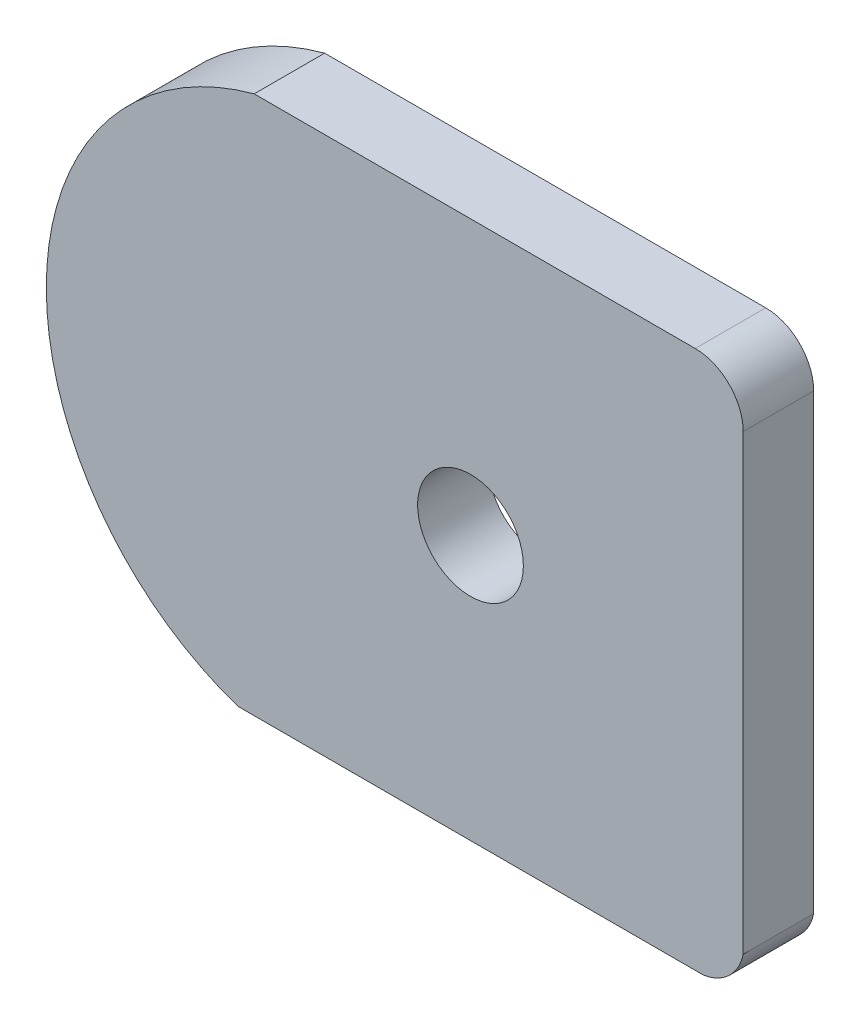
from build123d import *

# Parameters (mm, degrees)
BOSS_EXTRUDE1_DEPTH     = 2.54
CUT_EXTRUDE1_DEPTH      = 2.54
CUT_EXTRUDE1_DEPTH_BACK = 2.54
SKETCH4_R               = 1.905


with BuildPart() as part:
    # Sketch3 → Boss-Extrude1 (new body)
    with BuildSketch(Plane.XY):
        with BuildLine():
            Line((8.097404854, 9.881463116), (-7.795903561, 9.881463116))
            ThreePointArc((-7.795903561, 9.881463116), (-15.281410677, 0.396011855), (-8.383575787, -9.525))
            Line((-8.383575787, -9.525), (8.39911697, -9.525))
            ThreePointArc((8.39911697, -9.525), (9.327480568, -9.065355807), (9.826501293, -8.157550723))
            Line((9.826501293, -8.157550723), (9.826501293, 8.152366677))
            ThreePointArc((9.826501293, 8.152366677), (9.320060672, 9.375022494), (8.097404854, 9.881463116))
        make_face()
    extrude(amount=BOSS_EXTRUDE1_DEPTH)

    # Sketch4 → Cut-Extrude1 (cut, two sides: drawn at the far end of the back side and taken through both)
    with BuildSketch(Plane.XY.offset(-CUT_EXTRUDE1_DEPTH_BACK)):
        Circle(SKETCH4_R)
    extrude(amount=CUT_EXTRUDE1_DEPTH + CUT_EXTRUDE1_DEPTH_BACK, mode=Mode.SUBTRACT)


solid = part.part
